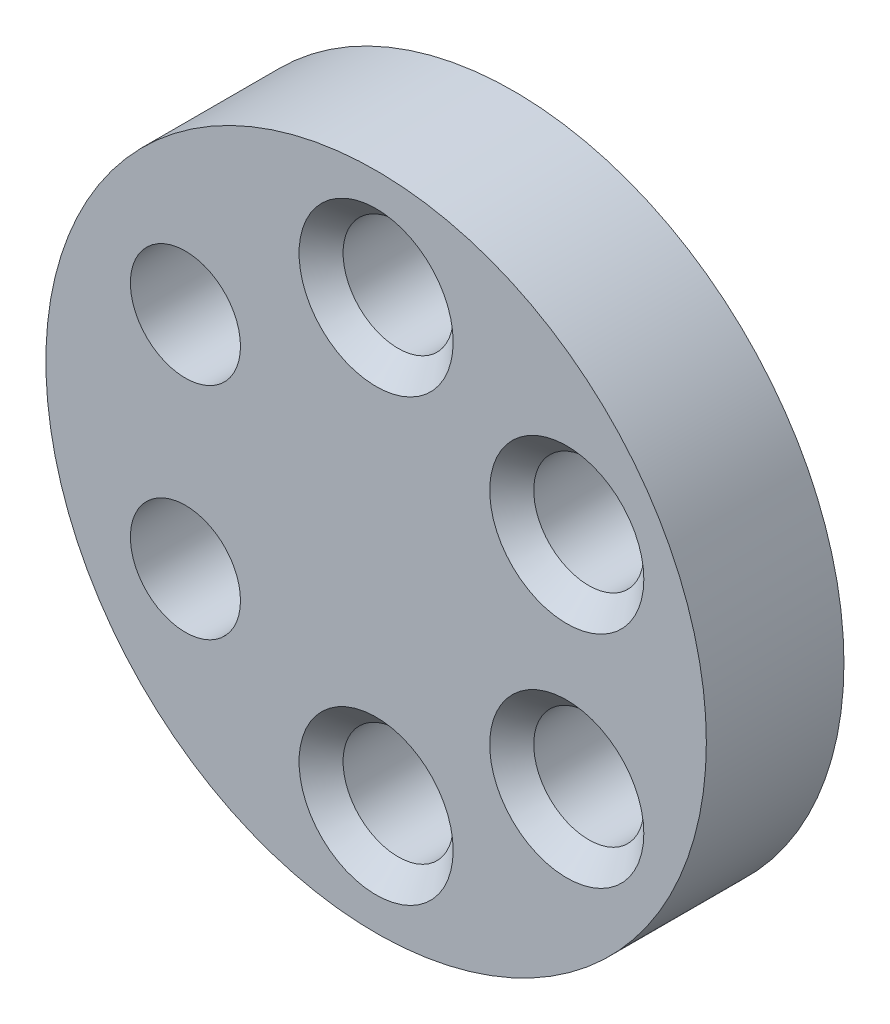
ISO-10303-21;
HEADER;
FILE_DESCRIPTION(('STEP AP214'),'2;1');
FILE_NAME('part.step','',(''),(''),'','','');
FILE_SCHEMA(('AUTOMOTIVE_DESIGN { 1 0 10303 214 1 1 1 1 }'));
ENDSEC;
DATA;
#1=APPLICATION_CONTEXT('core data for automotive mechanical design processes');
#2=APPLICATION_PROTOCOL_DEFINITION('international standard','automotive_design',2000,#1);
#3=PRODUCT_CONTEXT('',#1,'mechanical');
#4=PRODUCT('Part','Part','',(#3));
#5=PRODUCT_RELATED_PRODUCT_CATEGORY('part','',(#4));
#6=PRODUCT_DEFINITION_FORMATION('','',#4);
#7=PRODUCT_DEFINITION_CONTEXT('part definition',#1,'design');
#8=PRODUCT_DEFINITION('design','',#6,#7);
#9=PRODUCT_DEFINITION_SHAPE('','',#8);
#10=(LENGTH_UNIT() NAMED_UNIT(*) SI_UNIT(.MILLI.,.METRE.));
#11=(NAMED_UNIT(*) PLANE_ANGLE_UNIT() SI_UNIT($,.RADIAN.));
#12=(NAMED_UNIT(*) SI_UNIT($,.STERADIAN.) SOLID_ANGLE_UNIT());
#13=UNCERTAINTY_MEASURE_WITH_UNIT(LENGTH_MEASURE(1.E-05),#10,'distance_accuracy_value','');
#14=(GEOMETRIC_REPRESENTATION_CONTEXT(3) GLOBAL_UNCERTAINTY_ASSIGNED_CONTEXT((#13)) GLOBAL_UNIT_ASSIGNED_CONTEXT((#10,
#11,#12)) REPRESENTATION_CONTEXT('',''));
#15=CARTESIAN_POINT('',(0.,0.,0.));
#16=DIRECTION('',(0.,0.,1.));
#17=DIRECTION('',(1.,0.,0.));
#18=AXIS2_PLACEMENT_3D('',#15,#16,#17);
#19=CARTESIAN_POINT('',(0.,0.,25.));
#20=DIRECTION('',(0.,0.,1.));
#21=DIRECTION('',(1.,0.,0.));
#22=AXIS2_PLACEMENT_3D('',#19,#20,#21);
#23=PLANE('',#22);
#24=CARTESIAN_POINT('',(34.6410161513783,-19.9999999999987,25.));
#25=DIRECTION('',(0.,0.,1.));
#26=DIRECTION('',(1.,0.,0.));
#27=AXIS2_PLACEMENT_3D('',#24,#25,#26);
#28=CIRCLE('',#27,14.0000000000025);
#29=CARTESIAN_POINT('',(48.6410161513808,-19.9999999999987,25.));
#30=VERTEX_POINT('',#29);
#31=EDGE_CURVE('E57',#30,#30,#28,.F.);
#32=ORIENTED_EDGE('',*,*,#31,.T.);
#33=EDGE_LOOP('',(#32));
#34=FACE_BOUND('',#33,.T.);
#35=CARTESIAN_POINT('',(34.6410161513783,20.000000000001,25.));
#36=DIRECTION('',(0.,0.,1.));
#37=DIRECTION('',(1.,0.,0.));
#38=AXIS2_PLACEMENT_3D('',#35,#36,#37);
#39=CIRCLE('',#38,14.0000000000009);
#40=CARTESIAN_POINT('',(48.6410161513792,20.000000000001,25.));
#41=VERTEX_POINT('',#40);
#42=EDGE_CURVE('E60',#41,#41,#39,.F.);
#43=ORIENTED_EDGE('',*,*,#42,.T.);
#44=EDGE_LOOP('',(#43));
#45=FACE_BOUND('',#44,.T.);
#46=CARTESIAN_POINT('',(0.,40.,25.));
#47=DIRECTION('',(0.,0.,1.));
#48=DIRECTION('',(1.,0.,0.));
#49=AXIS2_PLACEMENT_3D('',#46,#47,#48);
#50=CIRCLE('',#49,14.);
#51=CARTESIAN_POINT('',(14.,40.,25.));
#52=VERTEX_POINT('',#51);
#53=EDGE_CURVE('E63',#52,#52,#50,.F.);
#54=ORIENTED_EDGE('',*,*,#53,.T.);
#55=EDGE_LOOP('',(#54));
#56=FACE_BOUND('',#55,.T.);
#57=CARTESIAN_POINT('',(2.26393958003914E-12,-40.,25.));
#58=DIRECTION('',(0.,0.,1.));
#59=DIRECTION('',(1.,0.,0.));
#60=AXIS2_PLACEMENT_3D('',#57,#58,#59);
#61=CIRCLE('',#60,14.0000000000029);
#62=CARTESIAN_POINT('',(14.0000000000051,-40.,25.));
#63=VERTEX_POINT('',#62);
#64=EDGE_CURVE('E66',#63,#63,#61,.F.);
#65=ORIENTED_EDGE('',*,*,#64,.T.);
#66=EDGE_LOOP('',(#65));
#67=FACE_BOUND('',#66,.T.);
#68=CARTESIAN_POINT('',(0.,0.,25.));
#69=DIRECTION('',(0.,0.,1.));
#70=DIRECTION('',(1.,0.,0.));
#71=AXIS2_PLACEMENT_3D('',#68,#69,#70);
#72=CIRCLE('',#71,60.);
#73=CARTESIAN_POINT('',(60.,0.,25.));
#74=VERTEX_POINT('',#73);
#75=EDGE_CURVE('E87',#74,#74,#72,.T.);
#76=ORIENTED_EDGE('',*,*,#75,.T.);
#77=EDGE_LOOP('',(#76));
#78=FACE_BOUND('',#77,.T.);
#79=CARTESIAN_POINT('',(-34.6410161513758,-20.000000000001,25.));
#80=DIRECTION('',(0.,0.,1.));
#81=DIRECTION('',(1.,0.,0.));
#82=AXIS2_PLACEMENT_3D('',#79,#80,#81);
#83=CIRCLE('',#82,10.0000000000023);
#84=CARTESIAN_POINT('',(-24.6410161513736,-20.000000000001,25.));
#85=VERTEX_POINT('',#84);
#86=EDGE_CURVE('E91',#85,#85,#83,.T.);
#87=ORIENTED_EDGE('',*,*,#86,.F.);
#88=EDGE_LOOP('',(#87));
#89=FACE_BOUND('',#88,.T.);
#90=CARTESIAN_POINT('',(-34.641016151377,19.999999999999,25.));
#91=DIRECTION('',(0.,0.,1.));
#92=DIRECTION('',(1.,0.,0.));
#93=AXIS2_PLACEMENT_3D('',#90,#91,#92);
#94=CIRCLE('',#93,10.0000000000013);
#95=CARTESIAN_POINT('',(-24.6410161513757,19.999999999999,25.));
#96=VERTEX_POINT('',#95);
#97=EDGE_CURVE('E97',#96,#96,#94,.T.);
#98=ORIENTED_EDGE('',*,*,#97,.F.);
#99=EDGE_LOOP('',(#98));
#100=FACE_BOUND('',#99,.T.);
#101=ADVANCED_FACE('F31',(#34,#45,#56,#67,#78,#89,#100),#23,.T.);
#102=CARTESIAN_POINT('',(0.,0.,0.));
#103=DIRECTION('',(0.,0.,1.));
#104=DIRECTION('',(1.,0.,0.));
#105=AXIS2_PLACEMENT_3D('',#102,#103,#104);
#106=PLANE('',#105);
#107=CARTESIAN_POINT('',(34.6410161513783,-19.9999999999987,0.));
#108=DIRECTION('',(0.,0.,1.));
#109=DIRECTION('',(1.,0.,0.));
#110=AXIS2_PLACEMENT_3D('',#107,#108,#109);
#111=CIRCLE('',#110,14.0000000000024);
#112=CARTESIAN_POINT('',(48.6410161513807,-19.9999999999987,0.));
#113=VERTEX_POINT('',#112);
#114=EDGE_CURVE('E75',#113,#113,#111,.T.);
#115=ORIENTED_EDGE('',*,*,#114,.T.);
#116=EDGE_LOOP('',(#115));
#117=FACE_BOUND('',#116,.T.);
#118=CARTESIAN_POINT('',(34.6410161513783,20.000000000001,0.));
#119=DIRECTION('',(0.,0.,1.));
#120=DIRECTION('',(1.,0.,0.));
#121=AXIS2_PLACEMENT_3D('',#118,#119,#120);
#122=CIRCLE('',#121,14.0000000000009);
#123=CARTESIAN_POINT('',(48.6410161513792,20.000000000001,0.));
#124=VERTEX_POINT('',#123);
#125=EDGE_CURVE('E78',#124,#124,#122,.T.);
#126=ORIENTED_EDGE('',*,*,#125,.T.);
#127=EDGE_LOOP('',(#126));
#128=FACE_BOUND('',#127,.T.);
#129=CARTESIAN_POINT('',(0.,40.,0.));
#130=DIRECTION('',(0.,0.,1.));
#131=DIRECTION('',(1.,0.,0.));
#132=AXIS2_PLACEMENT_3D('',#129,#130,#131);
#133=CIRCLE('',#132,14.);
#134=CARTESIAN_POINT('',(14.,40.,0.));
#135=VERTEX_POINT('',#134);
#136=EDGE_CURVE('E81',#135,#135,#133,.T.);
#137=ORIENTED_EDGE('',*,*,#136,.T.);
#138=EDGE_LOOP('',(#137));
#139=FACE_BOUND('',#138,.T.);
#140=CARTESIAN_POINT('',(2.26393958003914E-12,-40.,0.));
#141=DIRECTION('',(0.,0.,1.));
#142=DIRECTION('',(1.,0.,0.));
#143=AXIS2_PLACEMENT_3D('',#140,#141,#142);
#144=CIRCLE('',#143,14.0000000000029);
#145=CARTESIAN_POINT('',(14.0000000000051,-40.,0.));
#146=VERTEX_POINT('',#145);
#147=EDGE_CURVE('E84',#146,#146,#144,.T.);
#148=ORIENTED_EDGE('',*,*,#147,.T.);
#149=EDGE_LOOP('',(#148));
#150=FACE_BOUND('',#149,.T.);
#151=CARTESIAN_POINT('',(0.,0.,0.));
#152=DIRECTION('',(0.,0.,1.));
#153=DIRECTION('',(1.,0.,0.));
#154=AXIS2_PLACEMENT_3D('',#151,#152,#153);
#155=CIRCLE('',#154,60.);
#156=CARTESIAN_POINT('',(60.,0.,0.));
#157=VERTEX_POINT('',#156);
#158=EDGE_CURVE('E88',#157,#157,#155,.T.);
#159=ORIENTED_EDGE('',*,*,#158,.F.);
#160=EDGE_LOOP('',(#159));
#161=FACE_BOUND('',#160,.T.);
#162=CARTESIAN_POINT('',(-34.6410161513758,-20.000000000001,0.));
#163=DIRECTION('',(0.,0.,1.));
#164=DIRECTION('',(1.,0.,0.));
#165=AXIS2_PLACEMENT_3D('',#162,#163,#164);
#166=CIRCLE('',#165,10.0000000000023);
#167=CARTESIAN_POINT('',(-24.6410161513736,-20.000000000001,0.));
#168=VERTEX_POINT('',#167);
#169=EDGE_CURVE('E94',#168,#168,#166,.T.);
#170=ORIENTED_EDGE('',*,*,#169,.T.);
#171=EDGE_LOOP('',(#170));
#172=FACE_BOUND('',#171,.T.);
#173=CARTESIAN_POINT('',(-34.641016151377,19.999999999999,0.));
#174=DIRECTION('',(0.,0.,1.));
#175=DIRECTION('',(1.,0.,0.));
#176=AXIS2_PLACEMENT_3D('',#173,#174,#175);
#177=CIRCLE('',#176,10.0000000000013);
#178=CARTESIAN_POINT('',(-24.6410161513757,19.999999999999,0.));
#179=VERTEX_POINT('',#178);
#180=EDGE_CURVE('E100',#179,#179,#177,.T.);
#181=ORIENTED_EDGE('',*,*,#180,.T.);
#182=EDGE_LOOP('',(#181));
#183=FACE_BOUND('',#182,.T.);
#184=ADVANCED_FACE('F110',(#117,#128,#139,#150,#161,#172,#183),#106,.F.);
#185=CARTESIAN_POINT('',(0.,0.,25.));
#186=DIRECTION('',(0.,0.,-1.));
#187=DIRECTION('',(-1.,0.,0.));
#188=AXIS2_PLACEMENT_3D('',#185,#186,#187);
#189=CYLINDRICAL_SURFACE('',#188,60.);
#190=ORIENTED_EDGE('',*,*,#75,.F.);
#191=EDGE_LOOP('',(#190));
#192=FACE_BOUND('',#191,.T.);
#193=ORIENTED_EDGE('',*,*,#158,.T.);
#194=EDGE_LOOP('',(#193));
#195=FACE_BOUND('',#194,.T.);
#196=ADVANCED_FACE('F116',(#192,#195),#189,.T.);
#197=CARTESIAN_POINT('',(0.,40.,25.));
#198=DIRECTION('',(0.,0.,-1.));
#199=DIRECTION('',(-1.,0.,0.));
#200=AXIS2_PLACEMENT_3D('',#197,#198,#199);
#201=CYLINDRICAL_SURFACE('',#200,10.);
#202=CARTESIAN_POINT('',(0.,40.,4.00000000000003));
#203=DIRECTION('',(0.,0.,1.));
#204=DIRECTION('',(1.,0.,0.));
#205=AXIS2_PLACEMENT_3D('',#202,#203,#204);
#206=CIRCLE('',#205,10.);
#207=CARTESIAN_POINT('',(10.,40.,4.00000000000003));
#208=VERTEX_POINT('',#207);
#209=EDGE_CURVE('E42',#208,#208,#206,.F.);
#210=ORIENTED_EDGE('',*,*,#209,.T.);
#211=EDGE_LOOP('',(#210));
#212=FACE_BOUND('',#211,.T.);
#213=CARTESIAN_POINT('',(0.,40.,21.));
#214=DIRECTION('',(0.,0.,1.));
#215=DIRECTION('',(1.,0.,0.));
#216=AXIS2_PLACEMENT_3D('',#213,#214,#215);
#217=CIRCLE('',#216,10.);
#218=CARTESIAN_POINT('',(10.,40.,21.));
#219=VERTEX_POINT('',#218);
#220=EDGE_CURVE('E46',#219,#219,#217,.T.);
#221=ORIENTED_EDGE('',*,*,#220,.T.);
#222=EDGE_LOOP('',(#221));
#223=FACE_BOUND('',#222,.T.);
#224=ADVANCED_FACE('F121',(#212,#223),#201,.F.);
#225=CARTESIAN_POINT('',(-34.6410161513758,-20.000000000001,25.));
#226=DIRECTION('',(0.,0.,-1.));
#227=DIRECTION('',(-1.,0.,0.));
#228=AXIS2_PLACEMENT_3D('',#225,#226,#227);
#229=CYLINDRICAL_SURFACE('',#228,10.0000000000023);
#230=ORIENTED_EDGE('',*,*,#86,.T.);
#231=EDGE_LOOP('',(#230));
#232=FACE_BOUND('',#231,.T.);
#233=ORIENTED_EDGE('',*,*,#169,.F.);
#234=EDGE_LOOP('',(#233));
#235=FACE_BOUND('',#234,.T.);
#236=ADVANCED_FACE('F180',(#232,#235),#229,.F.);
#237=CARTESIAN_POINT('',(34.6410161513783,20.000000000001,25.));
#238=DIRECTION('',(0.,0.,-1.));
#239=DIRECTION('',(-1.,0.,0.));
#240=AXIS2_PLACEMENT_3D('',#237,#238,#239);
#241=CYLINDRICAL_SURFACE('',#240,10.0000000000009);
#242=CARTESIAN_POINT('',(34.6410161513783,20.000000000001,4.00000000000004));
#243=DIRECTION('',(0.,0.,1.));
#244=DIRECTION('',(1.,0.,0.));
#245=AXIS2_PLACEMENT_3D('',#242,#243,#244);
#246=CIRCLE('',#245,10.0000000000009);
#247=CARTESIAN_POINT('',(44.6410161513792,20.000000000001,4.00000000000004));
#248=VERTEX_POINT('',#247);
#249=EDGE_CURVE('E51',#248,#248,#246,.F.);
#250=ORIENTED_EDGE('',*,*,#249,.T.);
#251=EDGE_LOOP('',(#250));
#252=FACE_BOUND('',#251,.T.);
#253=CARTESIAN_POINT('',(34.6410161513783,20.000000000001,21.));
#254=DIRECTION('',(0.,0.,1.));
#255=DIRECTION('',(1.,0.,0.));
#256=AXIS2_PLACEMENT_3D('',#253,#254,#255);
#257=CIRCLE('',#256,10.0000000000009);
#258=CARTESIAN_POINT('',(44.6410161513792,20.000000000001,21.));
#259=VERTEX_POINT('',#258);
#260=EDGE_CURVE('E54',#259,#259,#257,.T.);
#261=ORIENTED_EDGE('',*,*,#260,.T.);
#262=EDGE_LOOP('',(#261));
#263=FACE_BOUND('',#262,.T.);
#264=ADVANCED_FACE('F177',(#252,#263),#241,.F.);
#265=CARTESIAN_POINT('',(34.6410161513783,-19.9999999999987,25.));
#266=DIRECTION('',(0.,0.,-1.));
#267=DIRECTION('',(-1.,0.,0.));
#268=AXIS2_PLACEMENT_3D('',#265,#266,#267);
#269=CYLINDRICAL_SURFACE('',#268,10.0000000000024);
#270=CARTESIAN_POINT('',(34.6410161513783,-19.9999999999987,4.));
#271=DIRECTION('',(0.,0.,1.));
#272=DIRECTION('',(1.,0.,0.));
#273=AXIS2_PLACEMENT_3D('',#270,#271,#272);
#274=CIRCLE('',#273,10.0000000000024);
#275=CARTESIAN_POINT('',(44.6410161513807,-19.9999999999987,4.));
#276=VERTEX_POINT('',#275);
#277=EDGE_CURVE('E69',#276,#276,#274,.F.);
#278=ORIENTED_EDGE('',*,*,#277,.T.);
#279=EDGE_LOOP('',(#278));
#280=FACE_BOUND('',#279,.T.);
#281=CARTESIAN_POINT('',(34.6410161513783,-19.9999999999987,21.));
#282=DIRECTION('',(0.,0.,1.));
#283=DIRECTION('',(1.,0.,0.));
#284=AXIS2_PLACEMENT_3D('',#281,#282,#283);
#285=CIRCLE('',#284,10.0000000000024);
#286=CARTESIAN_POINT('',(44.6410161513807,-19.9999999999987,21.));
#287=VERTEX_POINT('',#286);
#288=EDGE_CURVE('E72',#287,#287,#285,.T.);
#289=ORIENTED_EDGE('',*,*,#288,.T.);
#290=EDGE_LOOP('',(#289));
#291=FACE_BOUND('',#290,.T.);
#292=ADVANCED_FACE('F172',(#280,#291),#269,.F.);
#293=CARTESIAN_POINT('',(2.26393958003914E-12,-40.,25.));
#294=DIRECTION('',(0.,0.,-1.));
#295=DIRECTION('',(-1.,0.,0.));
#296=AXIS2_PLACEMENT_3D('',#293,#294,#295);
#297=CYLINDRICAL_SURFACE('',#296,10.0000000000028);
#298=CARTESIAN_POINT('',(2.26393958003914E-12,-40.,4.00000000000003));
#299=DIRECTION('',(0.,0.,1.));
#300=DIRECTION('',(1.,0.,0.));
#301=AXIS2_PLACEMENT_3D('',#298,#299,#300);
#302=CIRCLE('',#301,10.0000000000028);
#303=CARTESIAN_POINT('',(10.0000000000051,-40.,4.00000000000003));
#304=VERTEX_POINT('',#303);
#305=EDGE_CURVE('E10',#304,#304,#302,.F.);
#306=ORIENTED_EDGE('',*,*,#305,.T.);
#307=EDGE_LOOP('',(#306));
#308=FACE_BOUND('',#307,.T.);
#309=CARTESIAN_POINT('',(2.26393958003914E-12,-40.,21.));
#310=DIRECTION('',(0.,0.,1.));
#311=DIRECTION('',(1.,0.,0.));
#312=AXIS2_PLACEMENT_3D('',#309,#310,#311);
#313=CIRCLE('',#312,10.0000000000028);
#314=CARTESIAN_POINT('',(10.0000000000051,-40.,21.));
#315=VERTEX_POINT('',#314);
#316=EDGE_CURVE('E38',#315,#315,#313,.T.);
#317=ORIENTED_EDGE('',*,*,#316,.T.);
#318=EDGE_LOOP('',(#317));
#319=FACE_BOUND('',#318,.T.);
#320=ADVANCED_FACE('F167',(#308,#319),#297,.F.);
#321=CARTESIAN_POINT('',(-34.641016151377,19.999999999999,25.));
#322=DIRECTION('',(0.,0.,-1.));
#323=DIRECTION('',(-1.,0.,0.));
#324=AXIS2_PLACEMENT_3D('',#321,#322,#323);
#325=CYLINDRICAL_SURFACE('',#324,10.0000000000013);
#326=ORIENTED_EDGE('',*,*,#97,.T.);
#327=EDGE_LOOP('',(#326));
#328=FACE_BOUND('',#327,.T.);
#329=ORIENTED_EDGE('',*,*,#180,.F.);
#330=EDGE_LOOP('',(#329));
#331=FACE_BOUND('',#330,.T.);
#332=ADVANCED_FACE('F106',(#328,#331),#325,.F.);
#333=CARTESIAN_POINT('',(34.6410161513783,-19.9999999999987,0.));
#334=DIRECTION('',(0.,0.,-1.));
#335=DIRECTION('',(-1.,0.,0.));
#336=AXIS2_PLACEMENT_3D('',#333,#334,#335);
#337=CONICAL_SURFACE('',#336,14.0000000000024,0.785398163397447);
#338=ORIENTED_EDGE('',*,*,#277,.F.);
#339=EDGE_LOOP('',(#338));
#340=FACE_BOUND('',#339,.T.);
#341=ORIENTED_EDGE('',*,*,#114,.F.);
#342=EDGE_LOOP('',(#341));
#343=FACE_BOUND('',#342,.T.);
#344=ADVANCED_FACE('F127',(#340,#343),#337,.F.);
#345=CARTESIAN_POINT('',(34.6410161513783,-19.9999999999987,21.));
#346=DIRECTION('',(0.,0.,1.));
#347=DIRECTION('',(1.,0.,0.));
#348=AXIS2_PLACEMENT_3D('',#345,#346,#347);
#349=CONICAL_SURFACE('',#348,10.0000000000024,0.785398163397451);
#350=ORIENTED_EDGE('',*,*,#31,.F.);
#351=EDGE_LOOP('',(#350));
#352=FACE_BOUND('',#351,.T.);
#353=ORIENTED_EDGE('',*,*,#288,.F.);
#354=EDGE_LOOP('',(#353));
#355=FACE_BOUND('',#354,.T.);
#356=ADVANCED_FACE('F130',(#352,#355),#349,.F.);
#357=CARTESIAN_POINT('',(34.6410161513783,20.000000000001,0.));
#358=DIRECTION('',(0.,0.,-1.));
#359=DIRECTION('',(-1.,0.,0.));
#360=AXIS2_PLACEMENT_3D('',#357,#358,#359);
#361=CONICAL_SURFACE('',#360,14.0000000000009,0.785398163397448);
#362=ORIENTED_EDGE('',*,*,#249,.F.);
#363=EDGE_LOOP('',(#362));
#364=FACE_BOUND('',#363,.T.);
#365=ORIENTED_EDGE('',*,*,#125,.F.);
#366=EDGE_LOOP('',(#365));
#367=FACE_BOUND('',#366,.T.);
#368=ADVANCED_FACE('F134',(#364,#367),#361,.F.);
#369=CARTESIAN_POINT('',(34.6410161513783,20.000000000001,21.));
#370=DIRECTION('',(0.,0.,1.));
#371=DIRECTION('',(1.,0.,0.));
#372=AXIS2_PLACEMENT_3D('',#369,#370,#371);
#373=CONICAL_SURFACE('',#372,10.0000000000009,0.785398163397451);
#374=ORIENTED_EDGE('',*,*,#42,.F.);
#375=EDGE_LOOP('',(#374));
#376=FACE_BOUND('',#375,.T.);
#377=ORIENTED_EDGE('',*,*,#260,.F.);
#378=EDGE_LOOP('',(#377));
#379=FACE_BOUND('',#378,.T.);
#380=ADVANCED_FACE('F138',(#376,#379),#373,.F.);
#381=CARTESIAN_POINT('',(0.,40.,0.));
#382=DIRECTION('',(0.,0.,-1.));
#383=DIRECTION('',(-1.,0.,0.));
#384=AXIS2_PLACEMENT_3D('',#381,#382,#383);
#385=CONICAL_SURFACE('',#384,14.,0.785398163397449);
#386=ORIENTED_EDGE('',*,*,#209,.F.);
#387=EDGE_LOOP('',(#386));
#388=FACE_BOUND('',#387,.T.);
#389=ORIENTED_EDGE('',*,*,#136,.F.);
#390=EDGE_LOOP('',(#389));
#391=FACE_BOUND('',#390,.T.);
#392=ADVANCED_FACE('F142',(#388,#391),#385,.F.);
#393=CARTESIAN_POINT('',(0.,40.,21.));
#394=DIRECTION('',(0.,0.,1.));
#395=DIRECTION('',(1.,0.,0.));
#396=AXIS2_PLACEMENT_3D('',#393,#394,#395);
#397=CONICAL_SURFACE('',#396,10.,0.785398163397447);
#398=ORIENTED_EDGE('',*,*,#53,.F.);
#399=EDGE_LOOP('',(#398));
#400=FACE_BOUND('',#399,.T.);
#401=ORIENTED_EDGE('',*,*,#220,.F.);
#402=EDGE_LOOP('',(#401));
#403=FACE_BOUND('',#402,.T.);
#404=ADVANCED_FACE('F146',(#400,#403),#397,.F.);
#405=CARTESIAN_POINT('',(2.26393958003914E-12,-40.,0.));
#406=DIRECTION('',(0.,0.,-1.));
#407=DIRECTION('',(-1.,0.,0.));
#408=AXIS2_PLACEMENT_3D('',#405,#406,#407);
#409=CONICAL_SURFACE('',#408,14.0000000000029,0.785398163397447);
#410=ORIENTED_EDGE('',*,*,#305,.F.);
#411=EDGE_LOOP('',(#410));
#412=FACE_BOUND('',#411,.T.);
#413=ORIENTED_EDGE('',*,*,#147,.F.);
#414=EDGE_LOOP('',(#413));
#415=FACE_BOUND('',#414,.T.);
#416=ADVANCED_FACE('F149',(#412,#415),#409,.F.);
#417=CARTESIAN_POINT('',(2.26393958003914E-12,-40.,21.));
#418=DIRECTION('',(0.,0.,1.));
#419=DIRECTION('',(1.,0.,0.));
#420=AXIS2_PLACEMENT_3D('',#417,#418,#419);
#421=CONICAL_SURFACE('',#420,10.0000000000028,0.785398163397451);
#422=ORIENTED_EDGE('',*,*,#64,.F.);
#423=EDGE_LOOP('',(#422));
#424=FACE_BOUND('',#423,.T.);
#425=ORIENTED_EDGE('',*,*,#316,.F.);
#426=EDGE_LOOP('',(#425));
#427=FACE_BOUND('',#426,.T.);
#428=ADVANCED_FACE('F33',(#424,#427),#421,.F.);
#429=CLOSED_SHELL('',(#101,#184,#196,#224,#236,#264,#292,#320,#332,#344,#356,#368,#380,#392,
#404,#416,#428));
#430=MANIFOLD_SOLID_BREP('B2',#429);
#431=ADVANCED_BREP_SHAPE_REPRESENTATION('',(#18,#430),#14);
#432=SHAPE_DEFINITION_REPRESENTATION(#9,#431);
ENDSEC;
END-ISO-10303-21;
